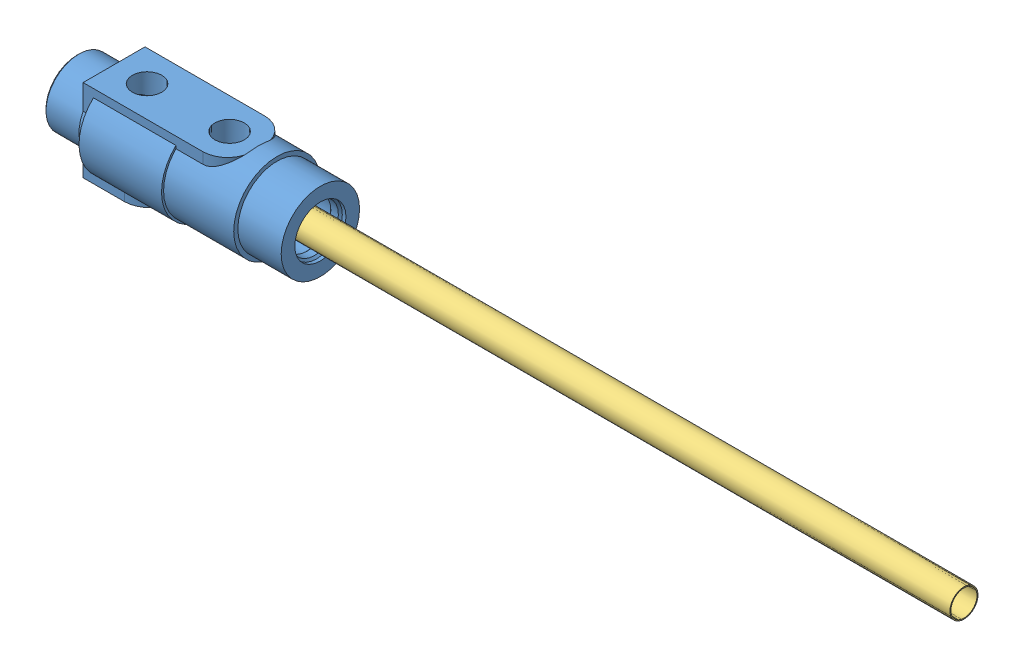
SolidWorks assembly RLQC1422.SLDASM, configuration Default (file format 13000). Lengths in mm.
Overall size (341.3 34.13 34.92).
4 component instances, 4 part files, 4 mates.
Components (placement in the parent):
- RLQCH1422-1: RLQCH1422.SLDPRT [Default] at origin size (93.65 34.13 34.92)
- BR25-1: BR25.sldprt [Default] at (-66.675 -15.875 0) x (-0.78964 0 -0.613571) z (-0.613571 0 0.78964) size (13.65 10.26 13.65)
- PT37-437L12-1: PT37-437L12.SLDPRT [PT37-437L12] at (-57.15 0 0) x (0 0.570569 -0.82125) z (0 -0.82125 -0.570569) size (16.91 304.8 16.91)
- BR50-1: BR50.SLDPRT [Default] at (-92.8878 0 0) x (0 -0.381849 0.924225) z (0 -0.924225 -0.381849) size (21.25 14 21.25)
Mates (geometry in assembly coordinates):
- ProfileCenter1: profile center = 0.762 mm aligned: plane of BR50-1 through (-92.8878 0 0) normal (-1 0 0); circle of RLQCH1422-1
- ProfileCenter2: profile center aligned: plane of BR25-1 through (-66.675 -15.875 0) normal (0 -1 0); circle of RLQCH1422-1
- Distance1: distance = 57.15 mm: plane of RLQCH1422-1 through (0 0 -11.6745) normal (1 0 0); plane of PT37-437L12-1 through (-57.15 0 0) normal (-1 0 0)
- Concentric1: concentric aligned: cylinder of RLQCH1422-1 through (-8.3361 0 0) axis (1 0 0) radius 15.0812; cylinder of PT37-437L12-1 through (-57.15 0 0) axis (1 0 0) radius 5.4229
